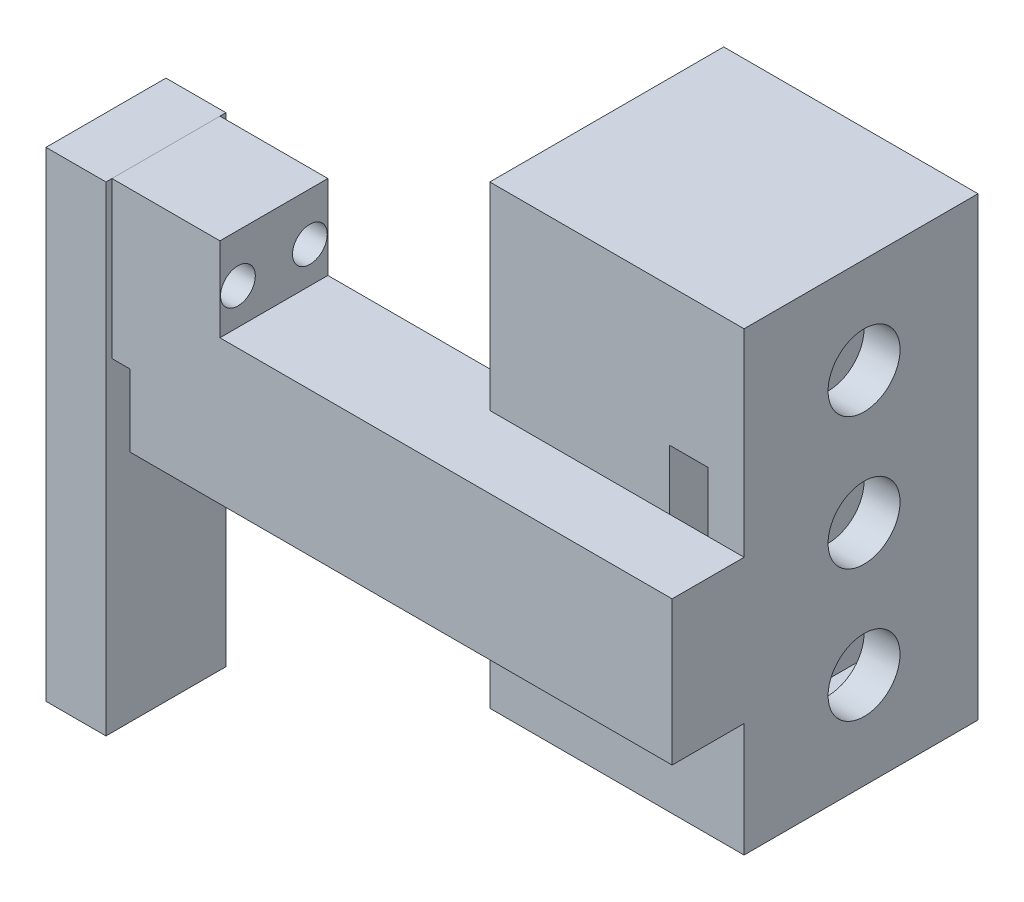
from build123d import *

# Parameters (mm, degrees)
SKETCH_1_W           = 16.5
SKETCH_1_H           = 38
SKETCH_1_R           = 3
EXTRUDE_1_DEPTH      = 3
EXTRUDE_START        = -3.2
SKETCH_2_W           = 16.5
SKETCH_2_H           = 38
SKETCH_2_R           = 4
SKETCH_2_R_2         = 5
EXTRUDE_2_DEPTH      = 3
EXTRUDE_START_2      = -15
SKETCH_3_W           = 16.5
SKETCH_3_H           = 38
SKETCH_3_R           = 3
SKETCH_3_R_2         = 5
EXTRUDE_3_DEPTH      = 3
SKETCH_7_W           = 21.2
SKETCH_7_H           = 3
EXTRUDE_4_DEPTH      = 16.5
EXTRUDE_5_DEPTH      = 3
EXTRUDE_6_DEPTH      = 9
CUT_EXTRUDE_1_DEPTH  = 3.2
EXTRUDE_7_DEPTH      = 9.5
EXTRUDE_7_DEPTH_BACK = 0.5
SKETCH_11_W          = 5
SKETCH_11_H          = 40
SKETCH_12_R          = 1.45
CUT_EXTRUDE_4_DEPTH  = 57.013748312


with BuildPart() as part:
    # Sketch 1 → Extrude 1 (new body)
    with BuildSketch(Plane(origin=(0, 0, 0), x_dir=(0, 0, -1), z_dir=(1, 0, 0))):
        with Locations((8.25, 19)):
            Rectangle(SKETCH_1_W, SKETCH_1_H)
        with Locations((7, 19)):
            Circle(SKETCH_1_R, mode=Mode.SUBTRACT)
        with Locations((7, 30)):
            Circle(SKETCH_1_R, mode=Mode.SUBTRACT)
        with Locations(Location((7, 8, 0), (0, 0, 180))):
            Circle(SKETCH_1_R, mode=Mode.SUBTRACT)
    extrude(amount=EXTRUDE_1_DEPTH)



with BuildPart() as body_2:
    # Sketch 2 → Extrude 2 (new body)
    with BuildSketch(Plane(origin=(0, 0, 0), x_dir=(0, 0, -1), z_dir=(1, 0, 0)).offset(EXTRUDE_START)):
        with Locations((8.25, 19)):
            Rectangle(SKETCH_2_W, SKETCH_2_H)
        with Locations((7, 19)):
            Circle(SKETCH_2_R, mode=Mode.SUBTRACT)
        with Locations((7, 30)):
            Circle(SKETCH_2_R_2, mode=Mode.SUBTRACT)
        with Locations(Location((7, 8, 0), (0, 0, 180))):
            Circle(SKETCH_2_R_2, mode=Mode.SUBTRACT)
    extrude(amount=-EXTRUDE_2_DEPTH)


with BuildPart() as body_3:
    # Sketch 3 → Extrude 3 (new body)
    with BuildSketch(Plane(origin=(-3.2, 0, 0), x_dir=(0, 0, -1), z_dir=(1, 0, 0)).offset(EXTRUDE_START_2)):
        with Locations((8.25, 19)):
            Rectangle(SKETCH_3_W, SKETCH_3_H)
        with Locations((7, 19)):
            Circle(SKETCH_3_R, mode=Mode.SUBTRACT)
        with Locations((7, 30)):
            Circle(SKETCH_3_R_2, mode=Mode.SUBTRACT)
        with Locations(Location((7, 8, 0), (0, 0, 180))):
            Circle(SKETCH_3_R_2, mode=Mode.SUBTRACT)
    extrude(amount=EXTRUDE_3_DEPTH)


with BuildPart() as part_1:
    add(part.part)

    add(body_2.part)  # Extrude 4 merges body 2

    add(body_3.part)  # Extrude 4 merges body 3
    # Sketch 7 → Extrude 4 (add, through all)
    with BuildSketch(Plane.XY):
        with Locations((-7.6, 36.5)):
            Rectangle(SKETCH_7_W, SKETCH_7_H)
        with Locations((-7.6, 1.5)):
            Rectangle(SKETCH_7_W, SKETCH_7_H)
    extrude(amount=-EXTRUDE_4_DEPTH)

    # Sketch 8 → Extrude 5 (add)
    with BuildSketch(Plane.XY):
        Polygon((-43.7, 15.5), (-42.2, 15.5), (-42.2, 9.5), (-18.2, 9.5), (-18.2, 0), (3, 0), (3, 38), (-18.2, 38), (-18.2, 21.5), (-34.7, 21.5), (-34.7, 28.5), (-43.7, 28.5), align=None)
    extrude(amount=EXTRUDE_5_DEPTH)

    # Sketch 9 → Extrude 6 (add)
    with BuildSketch(Plane.XY):
        Polygon((-34.7, 21.5), (-34.7, 28.5), (-43.7, 28.5), (-43.7, 15.5), (-42.2, 15.5), (-42.2, 9.5), (3, 9.5), (3, 21.5), align=None)
    extrude(amount=EXTRUDE_6_DEPTH)

    # Sketch 10 → Cut-Extrude 1 (cut)
    with BuildSketch(Plane(origin=(0, 0, 0), x_dir=(0, 0, -1), z_dir=(1, 0, 0))):
        Polygon((0, 26.487489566), (-3, 26.487489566), (-3, 21.25), (-6, 21.25), (-6, 16.75), (-3, 16.75), (-3, 11.512510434), (0, 11.512510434), (1.798136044, 17.531284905), align=None)
    extrude(amount=-CUT_EXTRUDE_1_DEPTH, mode=Mode.SUBTRACT)


with BuildPart() as body_2_2:
    # Sketch 11 → Extrude 7 (new, two sides: drawn at the far end of the back side and taken through both)
    with BuildSketch(Plane.XY.offset(-EXTRUDE_7_DEPTH_BACK)):
        with Locations((-46.2, 8.5)):
            Rectangle(SKETCH_11_W, SKETCH_11_H)
    extrude(amount=EXTRUDE_7_DEPTH + EXTRUDE_7_DEPTH_BACK)


with BuildPart() as cut_extrude_4_tool:
    # Sketch 12 → Cut-Extrude 4 (new, through all)
    with BuildSketch(Plane(origin=(-34.7, 0, 0), x_dir=(0, 0, -1), z_dir=(1, 0, 0))):
        with Locations(Location((-1.5, 24.5, 0), (0, 0, 90))):
            Circle(SKETCH_12_R)
        with Locations(Location((-7.5, 24.5, 0), (0, 0, 90))):
            Circle(SKETCH_12_R)
    extrude(amount=-CUT_EXTRUDE_4_DEPTH)


with BuildPart() as part_2:
    add(part_1.part)

    # Cut-Extrude 4: cut by cut_extrude_4_tool
    add(cut_extrude_4_tool.part, mode=Mode.SUBTRACT)


with BuildPart() as body_2_2_1:
    add(body_2_2.part)

    # Cut-Extrude 4: cut by cut_extrude_4_tool
    add(cut_extrude_4_tool.part, mode=Mode.SUBTRACT)


solid = Compound([part_2.part, body_2_2_1.part])
